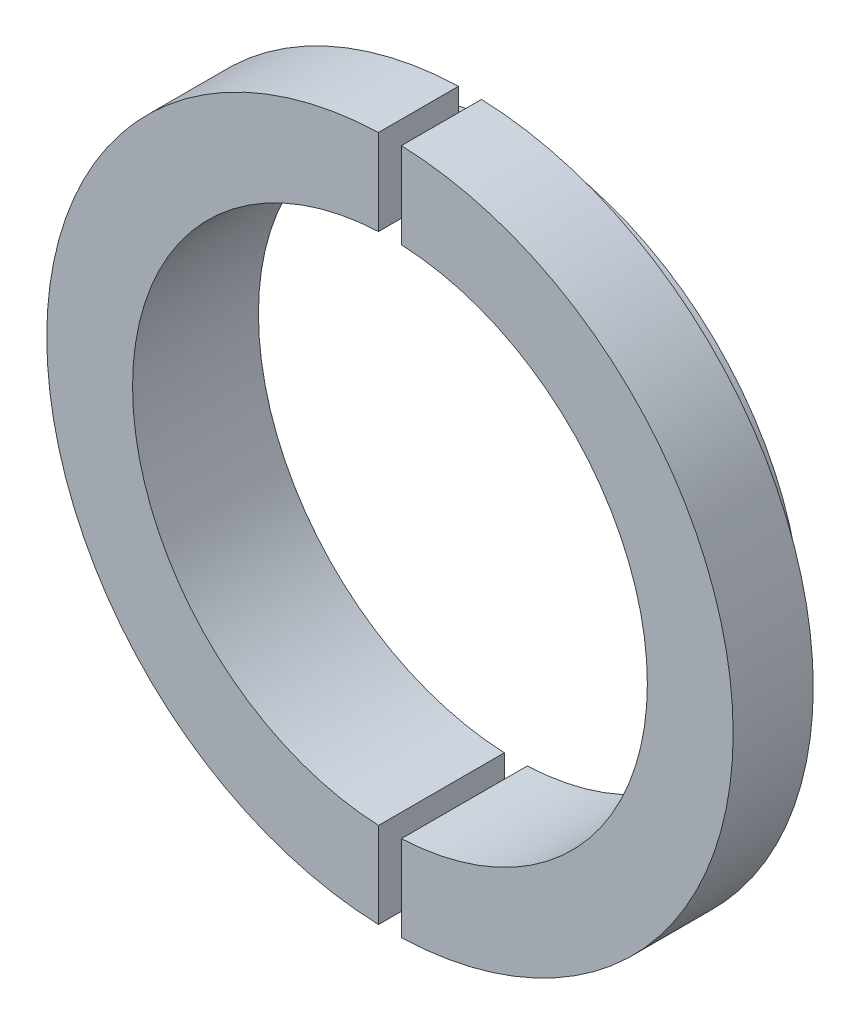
from build123d import *

# Parameters (mm, degrees)
ESQUISSE1_R             = 30
ESQUISSE1_R_2           = 22.5
BASE_EXTRUSION_DEPTH    = 11
ESQUISSE2_R             = 30
ESQUISSE2_R_2           = 25
ENL_V_MAT_EXTRU_1_DEPTH = 4
ESQUISSE3_W             = 2
ESQUISSE3_H             = 60
ENL_V_MAT_EXTRU_2_DEPTH = 44.829214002


with BuildPart() as part:
    # Esquisse1 → Base-Extrusion (new body)
    with BuildSketch(Plane.XY):
        Circle(ESQUISSE1_R)
        Circle(ESQUISSE1_R_2, mode=Mode.SUBTRACT)
    extrude(amount=BASE_EXTRUSION_DEPTH)

    # Esquisse2 → Enl_v. mat.-Extru.1 (cut)
    with BuildSketch(Plane(origin=(0, 0, 0), x_dir=(-1, 0, 0), z_dir=(0, 0, -1))):
        Circle(ESQUISSE2_R)
        Circle(ESQUISSE2_R_2, mode=Mode.SUBTRACT)
    extrude(amount=-ENL_V_MAT_EXTRU_1_DEPTH, mode=Mode.SUBTRACT)

    # Esquisse3 → Enl_v. mat.-Extru.2 (cut, through all)
    with BuildSketch(Plane.XY.offset(11)):
        Rectangle(ESQUISSE3_W, ESQUISSE3_H)
    extrude(amount=-ENL_V_MAT_EXTRU_2_DEPTH, mode=Mode.SUBTRACT)


with BuildPart() as enl_v_mat_extru_2_piece_1:
    # of the separate pieces the step leaves, piece 1, a body of its own (enl_v_mat_extru_2_pieces)
    add(part.part.solids().sort_by_distance((1, 29.983328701, 11))[0])


with BuildPart() as enl_v_mat_extru_2_piece_2:
    # of the separate pieces the step leaves, piece 2, a body of its own (enl_v_mat_extru_2_pieces)
    add(part.part.solids().sort_by_distance((-1, 22.477766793, 11))[0])


solid = Compound([enl_v_mat_extru_2_piece_1.part, enl_v_mat_extru_2_piece_2.part])
